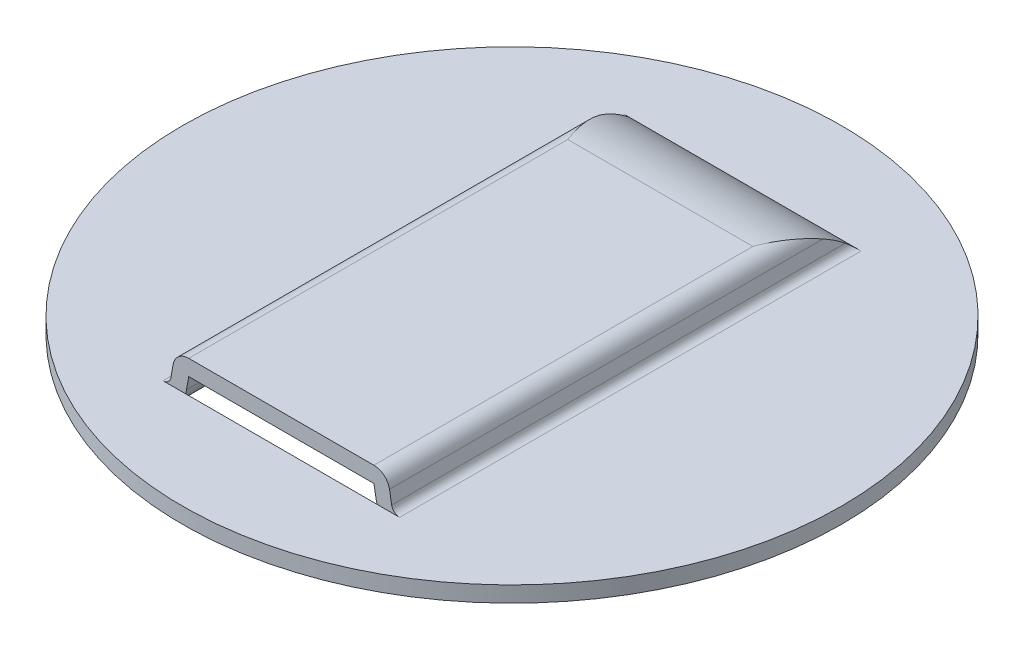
ISO-10303-21;
HEADER;
FILE_DESCRIPTION(('STEP AP214'),'2;1');
FILE_NAME('part.step','',(''),(''),'','','');
FILE_SCHEMA(('AUTOMOTIVE_DESIGN { 1 0 10303 214 1 1 1 1 }'));
ENDSEC;
DATA;
#1=APPLICATION_CONTEXT('core data for automotive mechanical design processes');
#2=APPLICATION_PROTOCOL_DEFINITION('international standard','automotive_design',2000,#1);
#3=PRODUCT_CONTEXT('',#1,'mechanical');
#4=PRODUCT('Part','Part','',(#3));
#5=PRODUCT_RELATED_PRODUCT_CATEGORY('part','',(#4));
#6=PRODUCT_DEFINITION_FORMATION('','',#4);
#7=PRODUCT_DEFINITION_CONTEXT('part definition',#1,'design');
#8=PRODUCT_DEFINITION('design','',#6,#7);
#9=PRODUCT_DEFINITION_SHAPE('','',#8);
#10=(LENGTH_UNIT() NAMED_UNIT(*) SI_UNIT(.MILLI.,.METRE.));
#11=(NAMED_UNIT(*) PLANE_ANGLE_UNIT() SI_UNIT($,.RADIAN.));
#12=(NAMED_UNIT(*) SI_UNIT($,.STERADIAN.) SOLID_ANGLE_UNIT());
#13=UNCERTAINTY_MEASURE_WITH_UNIT(LENGTH_MEASURE(1.E-05),#10,'distance_accuracy_value','');
#14=(GEOMETRIC_REPRESENTATION_CONTEXT(3) GLOBAL_UNCERTAINTY_ASSIGNED_CONTEXT((#13)) GLOBAL_UNIT_ASSIGNED_CONTEXT((#10,
#11,#12)) REPRESENTATION_CONTEXT('',''));
#15=CARTESIAN_POINT('',(0.,0.,0.));
#16=DIRECTION('',(0.,0.,1.));
#17=DIRECTION('',(1.,0.,0.));
#18=AXIS2_PLACEMENT_3D('',#15,#16,#17);
#19=CARTESIAN_POINT('',(8.26449914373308,1.45725418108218,35.56));
#20=DIRECTION('',(-0.984807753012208,-0.173648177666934,0.));
#21=DIRECTION('',(0.173648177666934,-0.984807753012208,0.));
#22=AXIS2_PLACEMENT_3D('',#19,#20,#21);
#23=PLANE('',#22);
#24=CARTESIAN_POINT('',(9.80804541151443,-7.29663170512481,6.35));
#25=DIRECTION('',(-0.984807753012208,-0.173648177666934,0.));
#26=DIRECTION('',(-0.173648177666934,0.984807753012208,0.));
#27=AXIS2_PLACEMENT_3D('',#24,#25,#26);
#28=ELLIPSE('',#27,9.48823744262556,9.34408979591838);
#29=CARTESIAN_POINT('',(8.33807761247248,1.03996994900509,2.1294447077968));
#30=VERTEX_POINT('',#29);
#31=CARTESIAN_POINT('',(8.50866922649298,0.0724968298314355,0.604744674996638));
#32=VERTEX_POINT('',#31);
#33=EDGE_CURVE('E332',#30,#32,#28,.T.);
#34=ORIENTED_EDGE('',*,*,#33,.F.);
#35=DIRECTION('',(0.,0.,-1.));
#36=VECTOR('',#35,1.);
#37=CARTESIAN_POINT('',(8.33807761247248,1.03996994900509,35.56));
#38=LINE('',#37,#36);
#39=CARTESIAN_POINT('',(8.33807761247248,1.03996994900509,35.56));
#40=VERTEX_POINT('',#39);
#41=EDGE_CURVE('E351',#40,#30,#38,.T.);
#42=ORIENTED_EDGE('',*,*,#41,.F.);
#43=DIRECTION('',(-0.173648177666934,0.984807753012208,0.));
#44=VECTOR('',#43,1.);
#45=CARTESIAN_POINT('',(8.50866922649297,0.0724968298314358,35.56));
#46=LINE('',#45,#44);
#47=CARTESIAN_POINT('',(8.50866922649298,0.0724968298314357,35.56));
#48=VERTEX_POINT('',#47);
#49=EDGE_CURVE('E319',#48,#40,#46,.T.);
#50=ORIENTED_EDGE('',*,*,#49,.F.);
#51=DIRECTION('',(0.,0.,-1.));
#52=VECTOR('',#51,1.);
#53=CARTESIAN_POINT('',(8.50866922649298,0.0724968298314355,35.56));
#54=LINE('',#53,#52);
#55=EDGE_CURVE('E329',#48,#32,#54,.T.);
#56=ORIENTED_EDGE('',*,*,#55,.T.);
#57=EDGE_LOOP('',(#34,#42,#50,#56));
#58=FACE_BOUND('',#57,.T.);
#59=ADVANCED_FACE('F18',(#58),#23,.F.);
#60=CARTESIAN_POINT('',(7.1374,0.828258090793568,35.56));
#61=DIRECTION('',(0.,0.,-1.));
#62=DIRECTION('',(-1.,0.,0.));
#63=AXIS2_PLACEMENT_3D('',#60,#61,#62);
#64=CYLINDRICAL_SURFACE('',#63,1.2192);
#65=DIRECTION('',(0.,0.,1.));
#66=VECTOR('',#65,1.);
#67=CARTESIAN_POINT('',(7.1374,2.04745809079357,35.56));
#68=LINE('',#67,#66);
#69=CARTESIAN_POINT('',(7.1374,2.04745809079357,6.35));
#70=VERTEX_POINT('',#69);
#71=CARTESIAN_POINT('',(7.1374,2.04745809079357,35.56));
#72=VERTEX_POINT('',#71);
#73=EDGE_CURVE('E349',#70,#72,#68,.T.);
#74=ORIENTED_EDGE('',*,*,#73,.T.);
#75=CARTESIAN_POINT('',(7.1374,0.828258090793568,35.56));
#76=DIRECTION('',(0.,0.,-1.));
#77=DIRECTION('',(-1.,0.,0.));
#78=AXIS2_PLACEMENT_3D('',#75,#76,#77);
#79=CIRCLE('',#78,1.2192);
#80=EDGE_CURVE('E318',#40,#72,#79,.F.);
#81=ORIENTED_EDGE('',*,*,#80,.F.);
#82=ORIENTED_EDGE('',*,*,#41,.T.);
#83=CARTESIAN_POINT('',(8.33807761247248,1.03996994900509,2.1294447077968));
#84=CARTESIAN_POINT('',(8.3309443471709,1.08035270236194,2.20920694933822));
#85=CARTESIAN_POINT('',(8.32195204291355,1.11951245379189,2.28940060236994));
#86=CARTESIAN_POINT('',(8.30069283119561,1.19534938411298,2.45048903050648));
#87=CARTESIAN_POINT('',(8.28842718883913,1.2320275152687,2.53138352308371));
#88=CARTESIAN_POINT('',(8.26108255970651,1.30283377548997,2.693631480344));
#89=CARTESIAN_POINT('',(8.24600853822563,1.33696625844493,2.77498389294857));
#90=CARTESIAN_POINT('',(8.21338718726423,1.4027563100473,2.93819612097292));
#91=CARTESIAN_POINT('',(8.19583958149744,1.43441360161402,3.02005599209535));
#92=CARTESIAN_POINT('',(8.14010864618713,1.5254521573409,3.26564357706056));
#93=CARTESIAN_POINT('',(8.09872466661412,1.58117780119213,3.43001735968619));
#94=CARTESIAN_POINT('',(8.00943554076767,1.68300280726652,3.76001443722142));
#95=CARTESIAN_POINT('',(7.9615270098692,1.72909714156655,3.92563833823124));
#96=CARTESIAN_POINT('',(7.85494361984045,1.8166261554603,4.27707230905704));
#97=CARTESIAN_POINT('',(7.79566462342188,1.85689583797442,4.4629903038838));
#98=CARTESIAN_POINT('',(7.67281950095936,1.92586416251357,4.83556587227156));
#99=CARTESIAN_POINT('',(7.60925173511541,1.95455834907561,5.02222370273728));
#100=CARTESIAN_POINT('',(7.41450701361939,2.02350611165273,5.58274329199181));
#101=CARTESIAN_POINT('',(7.2791752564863,2.0467122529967,5.95750567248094));
#102=CARTESIAN_POINT('',(7.14177864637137,2.0474521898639,6.33787806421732));
#103=CARTESIAN_POINT('',(7.13958929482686,2.04745808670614,6.343939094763));
#104=CARTESIAN_POINT('',(7.1374,2.04745809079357,6.35));
#105=B_SPLINE_CURVE_WITH_KNOTS('',3,(#83,#84,#85,#86,#87,#88,#89,#90,#91,#92,#93,#94,#95,#96,
#97,#98,#99,#100,#101,#102,#103,#104),.UNSPECIFIED.,.F.,.F.,(4,2,2,2,2,2,2,2,2,2,4),(0.,
0.269002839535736,0.537901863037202,0.806329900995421,1.07478794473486,1.60959462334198,
2.14467979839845,2.74198221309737,3.33951431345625,4.53343809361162,4.55277106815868),.UNSPECIFIED.);
#106=EDGE_CURVE('E162',#70,#30,#105,.F.);
#107=ORIENTED_EDGE('',*,*,#106,.F.);
#108=EDGE_LOOP('',(#74,#81,#82,#107));
#109=FACE_BOUND('',#108,.T.);
#110=ADVANCED_FACE('F178',(#109),#64,.T.);
#111=CARTESIAN_POINT('',(0.,2.04745809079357,35.56));
#112=DIRECTION('',(0.,-1.,0.));
#113=DIRECTION('',(1.,0.,0.));
#114=AXIS2_PLACEMENT_3D('',#111,#112,#113);
#115=PLANE('',#114);
#116=DIRECTION('',(0.,0.,-1.));
#117=VECTOR('',#116,1.);
#118=CARTESIAN_POINT('',(-7.1374,2.04745809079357,35.56));
#119=LINE('',#118,#117);
#120=CARTESIAN_POINT('',(-7.1374,2.04745809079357,35.56));
#121=VERTEX_POINT('',#120);
#122=CARTESIAN_POINT('',(-7.1374,2.04745809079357,6.35));
#123=VERTEX_POINT('',#122);
#124=EDGE_CURVE('E347',#121,#123,#119,.T.);
#125=ORIENTED_EDGE('',*,*,#124,.F.);
#126=DIRECTION('',(1.,0.,0.));
#127=VECTOR('',#126,1.);
#128=CARTESIAN_POINT('',(8.26449914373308,2.04745809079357,35.56));
#129=LINE('',#128,#127);
#130=EDGE_CURVE('E316',#72,#121,#129,.F.);
#131=ORIENTED_EDGE('',*,*,#130,.F.);
#132=ORIENTED_EDGE('',*,*,#73,.F.);
#133=DIRECTION('',(-1.,0.,0.));
#134=VECTOR('',#133,1.);
#135=CARTESIAN_POINT('',(25.4,2.04745809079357,6.35));
#136=LINE('',#135,#134);
#137=EDGE_CURVE('E154',#123,#70,#136,.F.);
#138=ORIENTED_EDGE('',*,*,#137,.F.);
#139=EDGE_LOOP('',(#125,#131,#132,#138));
#140=FACE_BOUND('',#139,.T.);
#141=ADVANCED_FACE('F175',(#140),#115,.F.);
#142=CARTESIAN_POINT('',(-7.1374,0.828258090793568,35.56));
#143=DIRECTION('',(0.,0.,-1.));
#144=DIRECTION('',(-1.,0.,0.));
#145=AXIS2_PLACEMENT_3D('',#142,#143,#144);
#146=CYLINDRICAL_SURFACE('',#145,1.2192);
#147=DIRECTION('',(0.,0.,1.));
#148=VECTOR('',#147,1.);
#149=CARTESIAN_POINT('',(-8.33807761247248,1.03996994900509,35.56));
#150=LINE('',#149,#148);
#151=CARTESIAN_POINT('',(-8.33807761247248,1.03996994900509,35.56));
#152=VERTEX_POINT('',#151);
#153=CARTESIAN_POINT('',(-8.33807761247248,1.03996994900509,2.12944470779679));
#154=VERTEX_POINT('',#153);
#155=EDGE_CURVE('E126',#152,#154,#150,.F.);
#156=ORIENTED_EDGE('',*,*,#155,.F.);
#157=CARTESIAN_POINT('',(-7.1374,0.828258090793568,35.56));
#158=DIRECTION('',(0.,0.,-1.));
#159=DIRECTION('',(-1.,0.,0.));
#160=AXIS2_PLACEMENT_3D('',#157,#158,#159);
#161=CIRCLE('',#160,1.2192);
#162=EDGE_CURVE('E315',#121,#152,#161,.F.);
#163=ORIENTED_EDGE('',*,*,#162,.F.);
#164=ORIENTED_EDGE('',*,*,#124,.T.);
#165=CARTESIAN_POINT('',(-8.33807761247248,1.03996994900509,2.1294447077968));
#166=CARTESIAN_POINT('',(-8.33094434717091,1.08035270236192,2.20920694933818));
#167=CARTESIAN_POINT('',(-8.32195204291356,1.11951245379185,2.28940060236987));
#168=CARTESIAN_POINT('',(-8.30069283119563,1.19534938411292,2.45048903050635));
#169=CARTESIAN_POINT('',(-8.28842718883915,1.23202751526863,2.53138352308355));
#170=CARTESIAN_POINT('',(-8.26108255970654,1.30283377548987,2.69363148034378));
#171=CARTESIAN_POINT('',(-8.24600853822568,1.33696625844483,2.77498389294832));
#172=CARTESIAN_POINT('',(-8.2133871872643,1.40275631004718,2.93819612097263));
#173=CARTESIAN_POINT('',(-8.19583958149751,1.4344136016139,3.02005599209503));
#174=CARTESIAN_POINT('',(-8.1401086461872,1.5254521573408,3.26564357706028));
#175=CARTESIAN_POINT('',(-8.09872466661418,1.58117780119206,3.43001735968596));
#176=CARTESIAN_POINT('',(-8.0094355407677,1.68300280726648,3.7600144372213));
#177=CARTESIAN_POINT('',(-7.9615270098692,1.72909714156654,3.92563833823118));
#178=CARTESIAN_POINT('',(-7.85494361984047,1.8166261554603,4.27707230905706));
#179=CARTESIAN_POINT('',(-7.79566462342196,1.85689583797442,4.46299030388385));
#180=CARTESIAN_POINT('',(-7.67281950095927,1.92586416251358,4.83556587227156));
#181=CARTESIAN_POINT('',(-7.60925173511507,1.95455834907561,5.02222370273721));
#182=CARTESIAN_POINT('',(-7.41450701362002,2.02350611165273,5.58274329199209));
#183=CARTESIAN_POINT('',(-7.27917525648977,2.04671225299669,5.95750567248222));
#184=CARTESIAN_POINT('',(-7.14177864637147,2.0474521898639,6.33787806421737));
#185=CARTESIAN_POINT('',(-7.13958929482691,2.04745808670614,6.34393909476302));
#186=CARTESIAN_POINT('',(-7.1374,2.04745809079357,6.35));
#187=B_SPLINE_CURVE_WITH_KNOTS('',3,(#165,#166,#167,#168,#169,#170,#171,#172,#173,#174,#175,
#176,#177,#178,#179,#180,#181,#182,#183,#184,#185,#186),.UNSPECIFIED.,.F.,.F.,(4,2,2,2,2,2,2,2,
2,2,4),(0.,0.26900283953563,0.53790186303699,0.806329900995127,1.07478794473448,1.6095946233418,
2.14467979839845,2.74198221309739,3.33951431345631,4.53343809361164,4.55277106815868),.UNSPECIFIED.);
#188=EDGE_CURVE('E152',#154,#123,#187,.T.);
#189=ORIENTED_EDGE('',*,*,#188,.F.);
#190=EDGE_LOOP('',(#156,#163,#164,#189));
#191=FACE_BOUND('',#190,.T.);
#192=ADVANCED_FACE('F170',(#191),#146,.T.);
#193=CARTESIAN_POINT('',(-8.26449914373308,1.45725418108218,35.56));
#194=DIRECTION('',(-0.984807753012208,0.173648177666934,0.));
#195=DIRECTION('',(-0.173648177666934,-0.984807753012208,0.));
#196=AXIS2_PLACEMENT_3D('',#193,#194,#195);
#197=PLANE('',#196);
#198=DIRECTION('',(-0.17364817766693,-0.984807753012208,0.));
#199=VECTOR('',#198,1.);
#200=CARTESIAN_POINT('',(-8.33807761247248,1.03996994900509,35.56));
#201=LINE('',#200,#199);
#202=CARTESIAN_POINT('',(-8.50866922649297,0.072496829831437,35.56));
#203=VERTEX_POINT('',#202);
#204=EDGE_CURVE('E313',#152,#203,#201,.T.);
#205=ORIENTED_EDGE('',*,*,#204,.F.);
#206=ORIENTED_EDGE('',*,*,#155,.T.);
#207=CARTESIAN_POINT('',(-9.80804541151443,-7.29663170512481,6.35));
#208=DIRECTION('',(-0.984807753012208,0.173648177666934,0.));
#209=DIRECTION('',(-0.173648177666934,-0.984807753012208,0.));
#210=AXIS2_PLACEMENT_3D('',#207,#208,#209);
#211=ELLIPSE('',#210,9.48823744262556,9.34408979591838);
#212=CARTESIAN_POINT('',(-8.50866922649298,0.0724968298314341,0.604744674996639));
#213=VERTEX_POINT('',#212);
#214=EDGE_CURVE('E147',#213,#154,#211,.F.);
#215=ORIENTED_EDGE('',*,*,#214,.F.);
#216=DIRECTION('',(0.,0.,-1.));
#217=VECTOR('',#216,1.);
#218=CARTESIAN_POINT('',(-8.50866922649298,0.072496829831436,35.56));
#219=LINE('',#218,#217);
#220=EDGE_CURVE('E133',#213,#203,#219,.F.);
#221=ORIENTED_EDGE('',*,*,#220,.T.);
#222=EDGE_LOOP('',(#205,#206,#215,#221));
#223=FACE_BOUND('',#222,.T.);
#224=ADVANCED_FACE('F151',(#223),#197,.T.);
#225=CARTESIAN_POINT('',(-9.12151509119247,0.180558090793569,35.56));
#226=DIRECTION('',(0.,0.,-1.));
#227=DIRECTION('',(-1.,0.,0.));
#228=AXIS2_PLACEMENT_3D('',#225,#226,#227);
#229=CYLINDRICAL_SURFACE('',#228,0.622300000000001);
#230=CARTESIAN_POINT('',(-9.11860010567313,-0.441735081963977,7.37008573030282E-06));
#231=CARTESIAN_POINT('',(-9.10503103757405,-0.441673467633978,7.4218741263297E-05));
#232=CARTESIAN_POINT('',(-9.09147515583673,-0.441163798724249,0.000624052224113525));
#233=CARTESIAN_POINT('',(-9.064506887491,-0.439272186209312,0.00266690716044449));
#234=CARTESIAN_POINT('',(-9.05109439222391,-0.43789095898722,0.00415915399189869));
#235=CARTESIAN_POINT('',(-9.01147189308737,-0.432509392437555,0.00997888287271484));
#236=CARTESIAN_POINT('',(-8.98560968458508,-0.427268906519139,0.015651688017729));
#237=CARTESIAN_POINT('',(-8.93570303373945,-0.413915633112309,0.0301638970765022));
#238=CARTESIAN_POINT('',(-8.91165354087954,-0.405811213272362,0.0389940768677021));
#239=CARTESIAN_POINT('',(-8.8656420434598,-0.387247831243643,0.0593228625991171));
#240=CARTESIAN_POINT('',(-8.84368498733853,-0.376783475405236,0.0708275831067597));
#241=CARTESIAN_POINT('',(-8.79326245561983,-0.349203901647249,0.101333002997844));
#242=CARTESIAN_POINT('',(-8.76598441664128,-0.331149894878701,0.121443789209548));
#243=CARTESIAN_POINT('',(-8.71608157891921,-0.292600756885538,0.16482309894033));
#244=CARTESIAN_POINT('',(-8.69346586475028,-0.272100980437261,0.188097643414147));
#245=CARTESIAN_POINT('',(-8.64290937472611,-0.219543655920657,0.248435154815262));
#246=CARTESIAN_POINT('',(-8.61748913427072,-0.186595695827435,0.286823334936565));
#247=CARTESIAN_POINT('',(-8.57473365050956,-0.119246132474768,0.366698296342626));
#248=CARTESIAN_POINT('',(-8.55741620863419,-0.0848415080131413,0.408191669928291));
#249=CARTESIAN_POINT('',(-8.53542341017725,-0.0297751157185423,0.475830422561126));
#250=CARTESIAN_POINT('',(-8.52847091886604,-0.00921493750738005,0.501354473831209));
#251=CARTESIAN_POINT('',(-8.51689722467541,0.0317534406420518,0.552771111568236));
#252=CARTESIAN_POINT('',(-8.51226127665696,0.052161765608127,0.578660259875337));
#253=CARTESIAN_POINT('',(-8.50866922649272,0.072496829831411,0.604744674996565));
#254=B_SPLINE_CURVE_WITH_KNOTS('',3,(#230,#231,#232,#233,#234,#235,#236,#237,#238,#239,#240,
#241,#242,#243,#244,#245,#246,#247,#248,#249,#250,#251,#252,#253),.UNSPECIFIED.,.F.,.F.,(4,2,2,
2,2,2,2,2,2,2,2,4),(0.,0.0406759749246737,0.0813185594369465,0.161814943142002,
0.242078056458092,0.32252650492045,0.437082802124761,0.551860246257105,0.720780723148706,
0.890070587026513,0.990508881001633,1.09029945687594),.UNSPECIFIED.);
#255=CARTESIAN_POINT('',(-9.11860006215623,-0.441738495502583,1.92650985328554E-06));
#256=VERTEX_POINT('',#255);
#257=EDGE_CURVE('E137',#256,#213,#254,.T.);
#258=ORIENTED_EDGE('',*,*,#257,.F.);
#259=CARTESIAN_POINT('',(-9.12151509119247,-0.441741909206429,0.));
#260=DIRECTION('',(1.,0.,0.));
#261=VECTOR('',#260,1.);
#262=LINE('',#259,#261);
#263=CARTESIAN_POINT('',(-9.12151509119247,-0.44174190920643,0.));
#264=VERTEX_POINT('',#263);
#265=EDGE_CURVE('E141',#264,#256,#262,.T.);
#266=ORIENTED_EDGE('',*,*,#265,.F.);
#267=DIRECTION('',(0.,0.,1.));
#268=VECTOR('',#267,1.);
#269=CARTESIAN_POINT('',(-9.12151509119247,-0.441741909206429,35.56));
#270=LINE('',#269,#268);
#271=CARTESIAN_POINT('',(-9.12151509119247,-0.441741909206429,35.56));
#272=VERTEX_POINT('',#271);
#273=EDGE_CURVE('E298',#272,#264,#270,.F.);
#274=ORIENTED_EDGE('',*,*,#273,.F.);
#275=CARTESIAN_POINT('',(-9.12151509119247,0.180558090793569,35.56));
#276=DIRECTION('',(0.,0.,-1.));
#277=DIRECTION('',(-1.,0.,0.));
#278=AXIS2_PLACEMENT_3D('',#275,#276,#277);
#279=CIRCLE('',#278,0.622300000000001);
#280=EDGE_CURVE('E140',#203,#272,#279,.T.);
#281=ORIENTED_EDGE('',*,*,#280,.F.);
#282=ORIENTED_EDGE('',*,*,#220,.F.);
#283=EDGE_LOOP('',(#258,#266,#274,#281,#282));
#284=FACE_BOUND('',#283,.T.);
#285=ADVANCED_FACE('F135',(#284),#229,.F.);
#286=CARTESIAN_POINT('',(25.4,-7.29663170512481,6.35));
#287=DIRECTION('',(-1.,0.,0.));
#288=DIRECTION('',(0.,0.,1.));
#289=AXIS2_PLACEMENT_3D('',#286,#287,#288);
#290=CYLINDRICAL_SURFACE('',#289,9.34408979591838);
#291=ORIENTED_EDGE('',*,*,#106,.T.);
#292=ORIENTED_EDGE('',*,*,#33,.T.);
#293=CARTESIAN_POINT('',(8.50866922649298,0.0724968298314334,0.604744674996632));
#294=CARTESIAN_POINT('',(8.51272734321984,0.049547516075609,0.575304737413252));
#295=CARTESIAN_POINT('',(8.51811237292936,0.0264907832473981,0.54609891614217));
#296=CARTESIAN_POINT('',(8.53182479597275,-0.0197166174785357,0.488269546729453));
#297=CARTESIAN_POINT('',(8.5401638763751,-0.0428672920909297,0.459648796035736));
#298=CARTESIAN_POINT('',(8.56019079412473,-0.0892932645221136,0.402929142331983));
#299=CARTESIAN_POINT('',(8.57192604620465,-0.11256539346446,0.374844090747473));
#300=CARTESIAN_POINT('',(8.59901979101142,-0.158508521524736,0.320034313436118));
#301=CARTESIAN_POINT('',(8.61437157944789,-0.181180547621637,0.293307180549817));
#302=CARTESIAN_POINT('',(8.64914327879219,-0.225543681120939,0.24157208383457));
#303=CARTESIAN_POINT('',(8.66857285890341,-0.247232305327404,0.216568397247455));
#304=CARTESIAN_POINT('',(8.71181343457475,-0.288799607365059,0.169118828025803));
#305=CARTESIAN_POINT('',(8.7356071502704,-0.30868497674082,0.146663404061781));
#306=CARTESIAN_POINT('',(8.78336234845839,-0.342520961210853,0.108775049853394));
#307=CARTESIAN_POINT('',(8.80658151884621,-0.356903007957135,0.0927994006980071));
#308=CARTESIAN_POINT('',(8.85622471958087,-0.383057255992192,0.0639136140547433));
#309=CARTESIAN_POINT('',(8.8826465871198,-0.394831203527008,0.0510014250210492));
#310=CARTESIAN_POINT('',(8.9329647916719,-0.412972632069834,0.0311870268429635));
#311=CARTESIAN_POINT('',(8.95637573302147,-0.419943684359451,0.0236074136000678));
#312=CARTESIAN_POINT('',(9.0045735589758,-0.431152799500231,0.0114447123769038));
#313=CARTESIAN_POINT('',(9.02935739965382,-0.435396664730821,0.00685526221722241));
#314=CARTESIAN_POINT('',(9.06555770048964,-0.439322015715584,0.00261309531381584));
#315=CARTESIAN_POINT('',(9.07670756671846,-0.440227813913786,0.00163478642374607));
#316=CARTESIAN_POINT('',(9.09907470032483,-0.441437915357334,0.000328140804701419));
#317=CARTESIAN_POINT('',(9.1102919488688,-0.441742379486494,-3.69774480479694E-07));
#318=CARTESIAN_POINT('',(9.12151509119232,-0.441741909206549,-5.76279261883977E-13));
#319=B_SPLINE_CURVE_WITH_KNOTS('',3,(#293,#294,#295,#296,#297,#298,#299,#300,#301,#302,#303,
#304,#305,#306,#307,#308,#309,#310,#311,#312,#313,#314,#315,#316,#317,#318),.UNSPECIFIED.,.F.,
.F.,(4,2,2,2,2,2,2,2,2,2,2,2,4),(0.,0.112657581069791,0.225765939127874,0.340536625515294,
0.455096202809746,0.569930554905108,0.684319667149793,0.778903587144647,0.87342398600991,
0.949842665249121,1.0260982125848,1.05975627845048,1.0934053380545),.UNSPECIFIED.);
#320=CARTESIAN_POINT('',(9.12151509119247,-0.441741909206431,1.84258597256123E-06));
#321=VERTEX_POINT('',#320);
#322=EDGE_CURVE('E325',#32,#321,#319,.T.);
#323=ORIENTED_EDGE('',*,*,#322,.T.);
#324=DIRECTION('',(-1.,0.,0.));
#325=VECTOR('',#324,1.);
#326=CARTESIAN_POINT('',(0.,-0.44174190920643,3.68517194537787E-06));
#327=LINE('',#326,#325);
#328=EDGE_CURVE('E150',#256,#321,#327,.F.);
#329=ORIENTED_EDGE('',*,*,#328,.F.);
#330=ORIENTED_EDGE('',*,*,#257,.T.);
#331=ORIENTED_EDGE('',*,*,#214,.T.);
#332=ORIENTED_EDGE('',*,*,#188,.T.);
#333=ORIENTED_EDGE('',*,*,#137,.T.);
#334=EDGE_LOOP('',(#291,#292,#323,#329,#330,#331,#332,#333));
#335=FACE_BOUND('',#334,.T.);
#336=ADVANCED_FACE('F145',(#335),#290,.T.);
#337=CARTESIAN_POINT('',(9.12151509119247,0.180558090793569,35.56));
#338=DIRECTION('',(0.,0.,-1.));
#339=DIRECTION('',(-1.,0.,0.));
#340=AXIS2_PLACEMENT_3D('',#337,#338,#339);
#341=CYLINDRICAL_SURFACE('',#340,0.622300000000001);
#342=ORIENTED_EDGE('',*,*,#322,.F.);
#343=ORIENTED_EDGE('',*,*,#55,.F.);
#344=CARTESIAN_POINT('',(9.12151509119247,0.180558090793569,35.56));
#345=DIRECTION('',(0.,0.,-1.));
#346=DIRECTION('',(-1.,0.,0.));
#347=AXIS2_PLACEMENT_3D('',#344,#345,#346);
#348=CIRCLE('',#347,0.622300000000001);
#349=CARTESIAN_POINT('',(9.12151509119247,-0.441741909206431,35.56));
#350=VERTEX_POINT('',#349);
#351=EDGE_CURVE('E321',#350,#48,#348,.T.);
#352=ORIENTED_EDGE('',*,*,#351,.F.);
#353=DIRECTION('',(0.,0.,1.));
#354=VECTOR('',#353,1.);
#355=CARTESIAN_POINT('',(9.12151509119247,-0.441741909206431,35.56));
#356=LINE('',#355,#354);
#357=EDGE_CURVE('E294',#321,#350,#356,.T.);
#358=ORIENTED_EDGE('',*,*,#357,.F.);
#359=EDGE_LOOP('',(#342,#343,#352,#358));
#360=FACE_BOUND('',#359,.T.);
#361=ADVANCED_FACE('F367',(#360),#341,.F.);
#362=CARTESIAN_POINT('',(-7.06382153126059,1.24554232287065,35.56));
#363=DIRECTION('',(-0.984807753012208,0.173648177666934,0.));
#364=DIRECTION('',(-0.173648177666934,-0.984807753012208,0.));
#365=AXIS2_PLACEMENT_3D('',#362,#363,#364);
#366=PLANE('',#365);
#367=DIRECTION('',(0.,0.,1.));
#368=VECTOR('',#367,1.);
#369=CARTESIAN_POINT('',(-7.1374,0.828258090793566,35.56));
#370=LINE('',#369,#368);
#371=CARTESIAN_POINT('',(-7.1374,0.828258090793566,35.56));
#372=VERTEX_POINT('',#371);
#373=CARTESIAN_POINT('',(-7.1374,0.828258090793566,6.35));
#374=VERTEX_POINT('',#373);
#375=EDGE_CURVE('E322',#372,#374,#370,.F.);
#376=ORIENTED_EDGE('',*,*,#375,.F.);
#377=DIRECTION('',(0.173648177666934,0.984807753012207,0.));
#378=VECTOR('',#377,1.);
#379=CARTESIAN_POINT('',(-7.30799161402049,-0.13921502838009,35.56));
#380=LINE('',#379,#378);
#381=CARTESIAN_POINT('',(-7.30799161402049,-0.13921502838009,35.56));
#382=VERTEX_POINT('',#381);
#383=EDGE_CURVE('E306',#382,#372,#380,.T.);
#384=ORIENTED_EDGE('',*,*,#383,.F.);
#385=DIRECTION('',(0.,0.,-1.));
#386=VECTOR('',#385,1.);
#387=CARTESIAN_POINT('',(-7.30799161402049,-0.139215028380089,35.56));
#388=LINE('',#387,#386);
#389=CARTESIAN_POINT('',(-7.30799161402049,-0.139215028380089,2.50484451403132));
#390=VERTEX_POINT('',#389);
#391=EDGE_CURVE('E289',#390,#382,#388,.F.);
#392=ORIENTED_EDGE('',*,*,#391,.F.);
#393=CARTESIAN_POINT('',(-8.57003728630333,-7.29663170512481,6.35));
#394=DIRECTION('',(-0.984807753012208,0.173648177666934,0.));
#395=DIRECTION('',(-0.173648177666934,-0.984807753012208,0.));
#396=AXIS2_PLACEMENT_3D('',#393,#394,#395);
#397=ELLIPSE('',#396,8.25022931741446,8.12488979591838);
#398=EDGE_CURVE('E226',#390,#374,#397,.F.);
#399=ORIENTED_EDGE('',*,*,#398,.T.);
#400=EDGE_LOOP('',(#376,#384,#392,#399));
#401=FACE_BOUND('',#400,.T.);
#402=ADVANCED_FACE('F421',(#401),#366,.F.);
#403=CARTESIAN_POINT('',(0.,0.828258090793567,35.56));
#404=DIRECTION('',(0.,-1.,0.));
#405=DIRECTION('',(1.,0.,0.));
#406=AXIS2_PLACEMENT_3D('',#403,#404,#405);
#407=PLANE('',#406);
#408=ORIENTED_EDGE('',*,*,#375,.T.);
#409=DIRECTION('',(-1.,0.,0.));
#410=VECTOR('',#409,1.);
#411=CARTESIAN_POINT('',(25.4,0.828258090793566,6.35));
#412=LINE('',#411,#410);
#413=CARTESIAN_POINT('',(7.1374,0.828258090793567,6.35));
#414=VERTEX_POINT('',#413);
#415=EDGE_CURVE('E225',#374,#414,#412,.F.);
#416=ORIENTED_EDGE('',*,*,#415,.T.);
#417=DIRECTION('',(0.,0.,1.));
#418=VECTOR('',#417,1.);
#419=CARTESIAN_POINT('',(7.1374,0.828258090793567,35.56));
#420=LINE('',#419,#418);
#421=CARTESIAN_POINT('',(7.1374,0.828258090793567,35.56));
#422=VERTEX_POINT('',#421);
#423=EDGE_CURVE('E299',#422,#414,#420,.F.);
#424=ORIENTED_EDGE('',*,*,#423,.F.);
#425=DIRECTION('',(1.,0.,0.));
#426=VECTOR('',#425,1.);
#427=CARTESIAN_POINT('',(8.26449914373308,0.828258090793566,35.56));
#428=LINE('',#427,#426);
#429=EDGE_CURVE('E324',#372,#422,#428,.T.);
#430=ORIENTED_EDGE('',*,*,#429,.F.);
#431=EDGE_LOOP('',(#408,#416,#424,#430));
#432=FACE_BOUND('',#431,.T.);
#433=ADVANCED_FACE('F429',(#432),#407,.T.);
#434=CARTESIAN_POINT('',(8.26449914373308,1.45725418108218,35.56));
#435=DIRECTION('',(0.,0.,1.));
#436=DIRECTION('',(1.,0.,0.));
#437=AXIS2_PLACEMENT_3D('',#434,#435,#436);
#438=PLANE('',#437);
#439=CARTESIAN_POINT('',(-9.12151509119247,0.180558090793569,35.56));
#440=DIRECTION('',(0.,0.,-1.));
#441=DIRECTION('',(-1.,0.,0.));
#442=AXIS2_PLACEMENT_3D('',#439,#440,#441);
#443=CIRCLE('',#442,1.8415);
#444=CARTESIAN_POINT('',(-7.3883489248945,-0.441741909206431,35.56));
#445=VERTEX_POINT('',#444);
#446=EDGE_CURVE('E236',#382,#445,#443,.T.);
#447=ORIENTED_EDGE('',*,*,#446,.F.);
#448=ORIENTED_EDGE('',*,*,#383,.T.);
#449=ORIENTED_EDGE('',*,*,#429,.T.);
#450=DIRECTION('',(0.173648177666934,-0.984807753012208,0.));
#451=VECTOR('',#450,1.);
#452=CARTESIAN_POINT('',(7.06382153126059,1.24554232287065,35.56));
#453=LINE('',#452,#451);
#454=CARTESIAN_POINT('',(7.30799161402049,-0.13921502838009,35.56));
#455=VERTEX_POINT('',#454);
#456=EDGE_CURVE('E301',#455,#422,#453,.F.);
#457=ORIENTED_EDGE('',*,*,#456,.F.);
#458=CARTESIAN_POINT('',(9.12151509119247,0.180558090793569,35.56));
#459=DIRECTION('',(0.,0.,-1.));
#460=DIRECTION('',(-1.,0.,0.));
#461=AXIS2_PLACEMENT_3D('',#458,#459,#460);
#462=CIRCLE('',#461,1.8415);
#463=CARTESIAN_POINT('',(7.3883489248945,-0.441741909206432,35.56));
#464=VERTEX_POINT('',#463);
#465=EDGE_CURVE('E220',#464,#455,#462,.T.);
#466=ORIENTED_EDGE('',*,*,#465,.F.);
#467=DIRECTION('',(-1.,0.,0.));
#468=VECTOR('',#467,1.);
#469=CARTESIAN_POINT('',(0.,-0.44174190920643,35.56));
#470=LINE('',#469,#468);
#471=EDGE_CURVE('E292',#350,#464,#470,.T.);
#472=ORIENTED_EDGE('',*,*,#471,.F.);
#473=ORIENTED_EDGE('',*,*,#351,.T.);
#474=ORIENTED_EDGE('',*,*,#49,.T.);
#475=ORIENTED_EDGE('',*,*,#80,.T.);
#476=ORIENTED_EDGE('',*,*,#130,.T.);
#477=ORIENTED_EDGE('',*,*,#162,.T.);
#478=ORIENTED_EDGE('',*,*,#204,.T.);
#479=ORIENTED_EDGE('',*,*,#280,.T.);
#480=DIRECTION('',(-1.,0.,0.));
#481=VECTOR('',#480,1.);
#482=CARTESIAN_POINT('',(0.,-0.44174190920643,35.56));
#483=LINE('',#482,#481);
#484=EDGE_CURVE('E295',#445,#272,#483,.T.);
#485=ORIENTED_EDGE('',*,*,#484,.F.);
#486=EDGE_LOOP('',(#447,#448,#449,#457,#466,#472,#473,#474,#475,#476,#477,#478,#479,#485));
#487=FACE_BOUND('',#486,.T.);
#488=ADVANCED_FACE('F438',(#487),#438,.T.);
#489=CARTESIAN_POINT('',(7.06382153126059,1.24554232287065,35.56));
#490=DIRECTION('',(-0.984807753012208,-0.173648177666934,0.));
#491=DIRECTION('',(0.173648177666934,-0.984807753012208,0.));
#492=AXIS2_PLACEMENT_3D('',#489,#490,#491);
#493=PLANE('',#492);
#494=ORIENTED_EDGE('',*,*,#423,.T.);
#495=CARTESIAN_POINT('',(8.57003728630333,-7.29663170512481,6.35));
#496=DIRECTION('',(-0.984807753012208,-0.173648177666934,0.));
#497=DIRECTION('',(-0.173648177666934,0.984807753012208,0.));
#498=AXIS2_PLACEMENT_3D('',#495,#496,#497);
#499=ELLIPSE('',#498,8.25022931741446,8.12488979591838);
#500=CARTESIAN_POINT('',(7.30799161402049,-0.139215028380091,2.50484451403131));
#501=VERTEX_POINT('',#500);
#502=EDGE_CURVE('E222',#414,#501,#499,.T.);
#503=ORIENTED_EDGE('',*,*,#502,.T.);
#504=DIRECTION('',(0.,0.,-1.));
#505=VECTOR('',#504,1.);
#506=CARTESIAN_POINT('',(7.30799161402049,-0.139215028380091,35.56));
#507=LINE('',#506,#505);
#508=EDGE_CURVE('E218',#455,#501,#507,.T.);
#509=ORIENTED_EDGE('',*,*,#508,.F.);
#510=ORIENTED_EDGE('',*,*,#456,.T.);
#511=EDGE_LOOP('',(#494,#503,#509,#510));
#512=FACE_BOUND('',#511,.T.);
#513=ADVANCED_FACE('F251',(#512),#493,.T.);
#514=CARTESIAN_POINT('',(0.,-0.44174190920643,35.56));
#515=DIRECTION('',(0.,1.,0.));
#516=DIRECTION('',(-1.,0.,0.));
#517=AXIS2_PLACEMENT_3D('',#514,#515,#516);
#518=PLANE('',#517);
#519=CARTESIAN_POINT('',(0.,-0.441741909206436,17.78));
#520=DIRECTION('',(0.,1.,0.));
#521=DIRECTION('',(-1.,0.,0.));
#522=AXIS2_PLACEMENT_3D('',#519,#520,#521);
#523=CIRCLE('',#522,25.4);
#524=CARTESIAN_POINT('',(-25.4,-0.441741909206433,17.78));
#525=VERTEX_POINT('',#524);
#526=EDGE_CURVE('E291',#525,#525,#523,.F.);
#527=ORIENTED_EDGE('',*,*,#526,.F.);
#528=EDGE_LOOP('',(#527));
#529=FACE_BOUND('',#528,.T.);
#530=ORIENTED_EDGE('',*,*,#471,.T.);
#531=DIRECTION('',(1.,0.,0.));
#532=VECTOR('',#531,1.);
#533=CARTESIAN_POINT('',(0.,-0.441741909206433,35.56));
#534=LINE('',#533,#532);
#535=EDGE_CURVE('E269',#464,#445,#534,.F.);
#536=ORIENTED_EDGE('',*,*,#535,.T.);
#537=ORIENTED_EDGE('',*,*,#484,.T.);
#538=ORIENTED_EDGE('',*,*,#273,.T.);
#539=ORIENTED_EDGE('',*,*,#265,.T.);
#540=ORIENTED_EDGE('',*,*,#328,.T.);
#541=ORIENTED_EDGE('',*,*,#357,.T.);
#542=EDGE_LOOP('',(#530,#536,#537,#538,#539,#540,#541));
#543=FACE_BOUND('',#542,.T.);
#544=ADVANCED_FACE('F246',(#529,#543),#518,.T.);
#545=CARTESIAN_POINT('',(0.,-0.441741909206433,17.78));
#546=DIRECTION('',(0.,1.,0.));
#547=DIRECTION('',(-1.,0.,0.));
#548=AXIS2_PLACEMENT_3D('',#545,#546,#547);
#549=CYLINDRICAL_SURFACE('',#548,25.4);
#550=CARTESIAN_POINT('',(0.,-1.66094190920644,17.78));
#551=DIRECTION('',(0.,1.,0.));
#552=DIRECTION('',(-1.,0.,0.));
#553=AXIS2_PLACEMENT_3D('',#550,#551,#552);
#554=CIRCLE('',#553,25.4);
#555=CARTESIAN_POINT('',(-25.4,-1.66094190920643,17.78));
#556=VERTEX_POINT('',#555);
#557=EDGE_CURVE('E261',#556,#556,#554,.T.);
#558=ORIENTED_EDGE('',*,*,#557,.T.);
#559=EDGE_LOOP('',(#558));
#560=FACE_BOUND('',#559,.T.);
#561=ORIENTED_EDGE('',*,*,#526,.T.);
#562=EDGE_LOOP('',(#561));
#563=FACE_BOUND('',#562,.T.);
#564=ADVANCED_FACE('F242',(#560,#563),#549,.T.);
#565=CARTESIAN_POINT('',(-9.12151509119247,0.180558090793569,35.56));
#566=DIRECTION('',(0.,0.,-1.));
#567=DIRECTION('',(-1.,0.,0.));
#568=AXIS2_PLACEMENT_3D('',#565,#566,#567);
#569=CYLINDRICAL_SURFACE('',#568,1.8415);
#570=CARTESIAN_POINT('',(-9.12151509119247,0.180558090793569,35.56));
#571=DIRECTION('',(0.,0.,-1.));
#572=DIRECTION('',(-1.,0.,0.));
#573=AXIS2_PLACEMENT_3D('',#570,#571,#572);
#574=CIRCLE('',#573,1.8415);
#575=CARTESIAN_POINT('',(-9.12151509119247,-1.66094190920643,35.56));
#576=VERTEX_POINT('',#575);
#577=EDGE_CURVE('E217',#445,#576,#574,.T.);
#578=ORIENTED_EDGE('',*,*,#577,.T.);
#579=DIRECTION('',(0.,0.,1.));
#580=VECTOR('',#579,1.);
#581=CARTESIAN_POINT('',(-9.12151509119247,-1.66094190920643,35.56));
#582=LINE('',#581,#580);
#583=CARTESIAN_POINT('',(-9.12151456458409,-1.66094190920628,0.497407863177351));
#584=VERTEX_POINT('',#583);
#585=EDGE_CURVE('E268',#576,#584,#582,.F.);
#586=ORIENTED_EDGE('',*,*,#585,.T.);
#587=CARTESIAN_POINT('',(-9.12151403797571,-1.66094190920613,0.497407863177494));
#588=CARTESIAN_POINT('',(-9.08093142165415,-1.66095109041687,0.49740268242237));
#589=CARTESIAN_POINT('',(-9.04035401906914,-1.65960060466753,0.498699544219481));
#590=CARTESIAN_POINT('',(-8.95955765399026,-1.65425020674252,0.503856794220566));
#591=CARTESIAN_POINT('',(-8.91933852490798,-1.65025159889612,0.507715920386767));
#592=CARTESIAN_POINT('',(-8.83981813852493,-1.63970815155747,0.517924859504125));
#593=CARTESIAN_POINT('',(-8.80051268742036,-1.63317955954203,0.52425878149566));
#594=CARTESIAN_POINT('',(-8.72285996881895,-1.61770952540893,0.539337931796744));
#595=CARTESIAN_POINT('',(-8.68451277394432,-1.60876790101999,0.548083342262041));
#596=CARTESIAN_POINT('',(-8.57143663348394,-1.57858795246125,0.577772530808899));
#597=CARTESIAN_POINT('',(-8.49847023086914,-1.55396652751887,0.602195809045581));
#598=CARTESIAN_POINT('',(-8.35893704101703,-1.49732673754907,0.659348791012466));
#599=CARTESIAN_POINT('',(-8.29238019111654,-1.46529714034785,0.692091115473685));
#600=CARTESIAN_POINT('',(-8.14735689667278,-1.38498799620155,0.775900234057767));
#601=CARTESIAN_POINT('',(-8.07145190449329,-1.33473204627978,0.829509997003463));
#602=CARTESIAN_POINT('',(-7.93254751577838,-1.22840044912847,0.94660392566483));
#603=CARTESIAN_POINT('',(-7.86956315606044,-1.17231813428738,1.01009944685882));
#604=CARTESIAN_POINT('',(-7.73247265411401,-1.03380928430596,1.17251231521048));
#605=CARTESIAN_POINT('',(-7.66437339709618,-0.949998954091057,1.27528756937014));
#606=CARTESIAN_POINT('',(-7.54855532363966,-0.782440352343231,1.49221318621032));
#607=CARTESIAN_POINT('',(-7.50092848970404,-0.698694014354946,1.60641210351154));
#608=CARTESIAN_POINT('',(-7.44107147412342,-0.574076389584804,1.78636359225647));
#609=CARTESIAN_POINT('',(-7.42279142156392,-0.531800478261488,1.84925449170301));
#610=CARTESIAN_POINT('',(-7.39023551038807,-0.448562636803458,1.97694799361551));
#611=CARTESIAN_POINT('',(-7.3759607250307,-0.407601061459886,2.04175110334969));
#612=CARTESIAN_POINT('',(-7.35106616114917,-0.327736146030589,2.17218862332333));
#613=CARTESIAN_POINT('',(-7.34040463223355,-0.288814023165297,2.23780376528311));
#614=CARTESIAN_POINT('',(-7.32207134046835,-0.212694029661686,2.37036283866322));
#615=CARTESIAN_POINT('',(-7.31439697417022,-0.175494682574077,2.43730555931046));
#616=CARTESIAN_POINT('',(-7.30799161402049,-0.139215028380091,2.50484451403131));
#617=B_SPLINE_CURVE_WITH_KNOTS('',3,(#587,#588,#589,#590,#591,#592,#593,#594,#595,#596,#597,
#598,#599,#600,#601,#602,#603,#604,#605,#606,#607,#608,#609,#610,#611,#612,#613,#614,#615,#616),
.UNSPECIFIED.,.F.,.F.,(4,2,2,2,2,2,2,2,2,2,2,2,2,2,4),(0.,0.121696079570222,0.243332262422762,
0.364199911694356,0.485076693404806,0.726218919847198,0.967729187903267,1.28292052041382,
1.59847661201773,2.04324818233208,2.48999773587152,2.72374368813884,2.95755221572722,
3.18855886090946,3.41936372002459),.UNSPECIFIED.);
#618=EDGE_CURVE('E229',#584,#390,#617,.T.);
#619=ORIENTED_EDGE('',*,*,#618,.T.);
#620=ORIENTED_EDGE('',*,*,#391,.T.);
#621=ORIENTED_EDGE('',*,*,#446,.T.);
#622=EDGE_LOOP('',(#578,#586,#619,#620,#621));
#623=FACE_BOUND('',#622,.T.);
#624=ADVANCED_FACE('F238',(#623),#569,.T.);
#625=CARTESIAN_POINT('',(25.4,-7.29663170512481,6.35));
#626=DIRECTION('',(-1.,0.,0.));
#627=DIRECTION('',(0.,0.,1.));
#628=AXIS2_PLACEMENT_3D('',#625,#626,#627);
#629=CYLINDRICAL_SURFACE('',#628,8.12488979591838);
#630=ORIENTED_EDGE('',*,*,#502,.F.);
#631=ORIENTED_EDGE('',*,*,#415,.F.);
#632=ORIENTED_EDGE('',*,*,#398,.F.);
#633=ORIENTED_EDGE('',*,*,#618,.F.);
#634=DIRECTION('',(-1.,0.,0.));
#635=VECTOR('',#634,1.);
#636=CARTESIAN_POINT('',(0.,-1.66094190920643,0.497407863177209));
#637=LINE('',#636,#635);
#638=CARTESIAN_POINT('',(9.12151509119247,-1.66094190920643,0.497407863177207));
#639=VERTEX_POINT('',#638);
#640=EDGE_CURVE('E281',#584,#639,#637,.F.);
#641=ORIENTED_EDGE('',*,*,#640,.T.);
#642=CARTESIAN_POINT('',(7.30799161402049,-0.139215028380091,2.50484451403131));
#643=CARTESIAN_POINT('',(7.31300817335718,-0.16765045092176,2.45191366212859));
#644=CARTESIAN_POINT('',(7.3188069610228,-0.196641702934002,2.39935886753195));
#645=CARTESIAN_POINT('',(7.33217766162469,-0.255690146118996,2.29505612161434));
#646=CARTESIAN_POINT('',(7.33975021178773,-0.285747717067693,2.24330846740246));
#647=CARTESIAN_POINT('',(7.36553245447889,-0.377765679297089,2.08883475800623));
#648=CARTESIAN_POINT('',(7.38675476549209,-0.441248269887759,1.98747877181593));
#649=CARTESIAN_POINT('',(7.43948443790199,-0.572419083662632,1.78784132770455));
#650=CARTESIAN_POINT('',(7.47114980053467,-0.640158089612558,1.68963426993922));
#651=CARTESIAN_POINT('',(7.54681807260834,-0.777338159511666,1.49960882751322));
#652=CARTESIAN_POINT('',(7.59078614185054,-0.846773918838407,1.40777330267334));
#653=CARTESIAN_POINT('',(7.66472606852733,-0.946533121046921,1.28121857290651));
#654=CARTESIAN_POINT('',(7.68883178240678,-0.977076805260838,1.2432045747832));
#655=CARTESIAN_POINT('',(7.74009311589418,-1.03779111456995,1.1689723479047));
#656=CARTESIAN_POINT('',(7.76724894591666,-1.06796171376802,1.13275424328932));
#657=CARTESIAN_POINT('',(7.85335654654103,-1.15724653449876,1.02738765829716));
#658=CARTESIAN_POINT('',(7.9171238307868,-1.21537885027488,0.961218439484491));
#659=CARTESIAN_POINT('',(8.05940271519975,-1.32651216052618,0.838333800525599));
#660=CARTESIAN_POINT('',(8.13809969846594,-1.37943433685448,0.781756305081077));
#661=CARTESIAN_POINT('',(8.26625467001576,-1.45102234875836,0.706960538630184));
#662=CARTESIAN_POINT('',(8.31066243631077,-1.47358751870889,0.683705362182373));
#663=CARTESIAN_POINT('',(8.40261609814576,-1.515572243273,0.640877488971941));
#664=CARTESIAN_POINT('',(8.45016049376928,-1.53499328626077,0.621303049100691));
#665=CARTESIAN_POINT('',(8.56848099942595,-1.57748045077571,0.578830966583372));
#666=CARTESIAN_POINT('',(8.64067678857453,-1.59868908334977,0.557951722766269));
#667=CARTESIAN_POINT('',(8.78895681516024,-1.63225195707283,0.525122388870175));
#668=CARTESIAN_POINT('',(8.86503267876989,-1.64462446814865,0.513153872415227));
#669=CARTESIAN_POINT('',(8.97170610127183,-1.65508389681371,0.503053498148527));
#670=CARTESIAN_POINT('',(9.00159948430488,-1.65727876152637,0.500937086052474));
#671=CARTESIAN_POINT('',(9.06149581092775,-1.66020702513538,0.498115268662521));
#672=CARTESIAN_POINT('',(9.09149862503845,-1.66094179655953,0.497408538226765));
#673=CARTESIAN_POINT('',(9.12151509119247,-1.66094190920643,0.497407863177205));
#674=B_SPLINE_CURVE_WITH_KNOTS('',3,(#642,#643,#644,#645,#646,#647,#648,#649,#650,#651,#652,
#653,#654,#655,#656,#657,#658,#659,#660,#661,#662,#663,#664,#665,#666,#667,#668,#669,#670,#671,
#672,#673),.UNSPECIFIED.,.F.,.F.,(4,2,2,2,2,2,2,2,2,2,2,2,2,2,2,4),(0.,0.180865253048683,
0.361795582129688,0.725703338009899,1.09539094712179,1.46404204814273,1.62713353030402,
1.79023627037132,2.1151589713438,2.44441717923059,2.60907642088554,2.77365748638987,
3.0068738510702,3.23960660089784,3.32969645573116,3.41970158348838),.UNSPECIFIED.);
#675=EDGE_CURVE('E210',#501,#639,#674,.T.);
#676=ORIENTED_EDGE('',*,*,#675,.F.);
#677=EDGE_LOOP('',(#630,#631,#632,#633,#641,#676));
#678=FACE_BOUND('',#677,.T.);
#679=ADVANCED_FACE('F205',(#678),#629,.F.);
#680=CARTESIAN_POINT('',(9.12151509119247,0.180558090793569,35.56));
#681=DIRECTION('',(0.,0.,-1.));
#682=DIRECTION('',(-1.,0.,0.));
#683=AXIS2_PLACEMENT_3D('',#680,#681,#682);
#684=CYLINDRICAL_SURFACE('',#683,1.8415);
#685=ORIENTED_EDGE('',*,*,#675,.T.);
#686=DIRECTION('',(0.,0.,1.));
#687=VECTOR('',#686,1.);
#688=CARTESIAN_POINT('',(9.12151509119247,-1.66094190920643,35.56));
#689=LINE('',#688,#687);
#690=CARTESIAN_POINT('',(9.12151509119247,-1.66094190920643,35.56));
#691=VERTEX_POINT('',#690);
#692=EDGE_CURVE('E33',#639,#691,#689,.T.);
#693=ORIENTED_EDGE('',*,*,#692,.T.);
#694=CARTESIAN_POINT('',(9.12151509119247,0.180558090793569,35.56));
#695=DIRECTION('',(0.,0.,-1.));
#696=DIRECTION('',(-1.,0.,0.));
#697=AXIS2_PLACEMENT_3D('',#694,#695,#696);
#698=CIRCLE('',#697,1.8415);
#699=EDGE_CURVE('E41',#691,#464,#698,.T.);
#700=ORIENTED_EDGE('',*,*,#699,.T.);
#701=ORIENTED_EDGE('',*,*,#465,.T.);
#702=ORIENTED_EDGE('',*,*,#508,.T.);
#703=EDGE_LOOP('',(#685,#693,#700,#701,#702));
#704=FACE_BOUND('',#703,.T.);
#705=ADVANCED_FACE('F197',(#704),#684,.T.);
#706=CARTESIAN_POINT('',(0.,-0.441741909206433,35.56));
#707=DIRECTION('',(0.,0.,1.));
#708=DIRECTION('',(1.,0.,0.));
#709=AXIS2_PLACEMENT_3D('',#706,#707,#708);
#710=PLANE('',#709);
#711=ORIENTED_EDGE('',*,*,#699,.F.);
#712=DIRECTION('',(-1.,0.,0.));
#713=VECTOR('',#712,1.);
#714=CARTESIAN_POINT('',(0.,-1.66094190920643,35.56));
#715=LINE('',#714,#713);
#716=EDGE_CURVE('E11',#691,#576,#715,.T.);
#717=ORIENTED_EDGE('',*,*,#716,.T.);
#718=ORIENTED_EDGE('',*,*,#577,.F.);
#719=ORIENTED_EDGE('',*,*,#535,.F.);
#720=EDGE_LOOP('',(#711,#717,#718,#719));
#721=FACE_BOUND('',#720,.T.);
#722=ADVANCED_FACE('F191',(#721),#710,.F.);
#723=CARTESIAN_POINT('',(0.,-1.66094190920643,35.56));
#724=DIRECTION('',(0.,1.,0.));
#725=DIRECTION('',(-1.,0.,0.));
#726=AXIS2_PLACEMENT_3D('',#723,#724,#725);
#727=PLANE('',#726);
#728=ORIENTED_EDGE('',*,*,#692,.F.);
#729=ORIENTED_EDGE('',*,*,#640,.F.);
#730=ORIENTED_EDGE('',*,*,#585,.F.);
#731=ORIENTED_EDGE('',*,*,#716,.F.);
#732=EDGE_LOOP('',(#728,#729,#730,#731));
#733=FACE_BOUND('',#732,.T.);
#734=ORIENTED_EDGE('',*,*,#557,.F.);
#735=EDGE_LOOP('',(#734));
#736=FACE_BOUND('',#735,.T.);
#737=ADVANCED_FACE('F189',(#733,#736),#727,.F.);
#738=CLOSED_SHELL('',(#59,#110,#141,#192,#224,#285,#336,#361,#402,#433,#488,#513,#544,#564,#624,
#679,#705,#722,#737));
#739=MANIFOLD_SOLID_BREP('B1',#738);
#740=ADVANCED_BREP_SHAPE_REPRESENTATION('',(#18,#739),#14);
#741=SHAPE_DEFINITION_REPRESENTATION(#9,#740);
ENDSEC;
END-ISO-10303-21;
